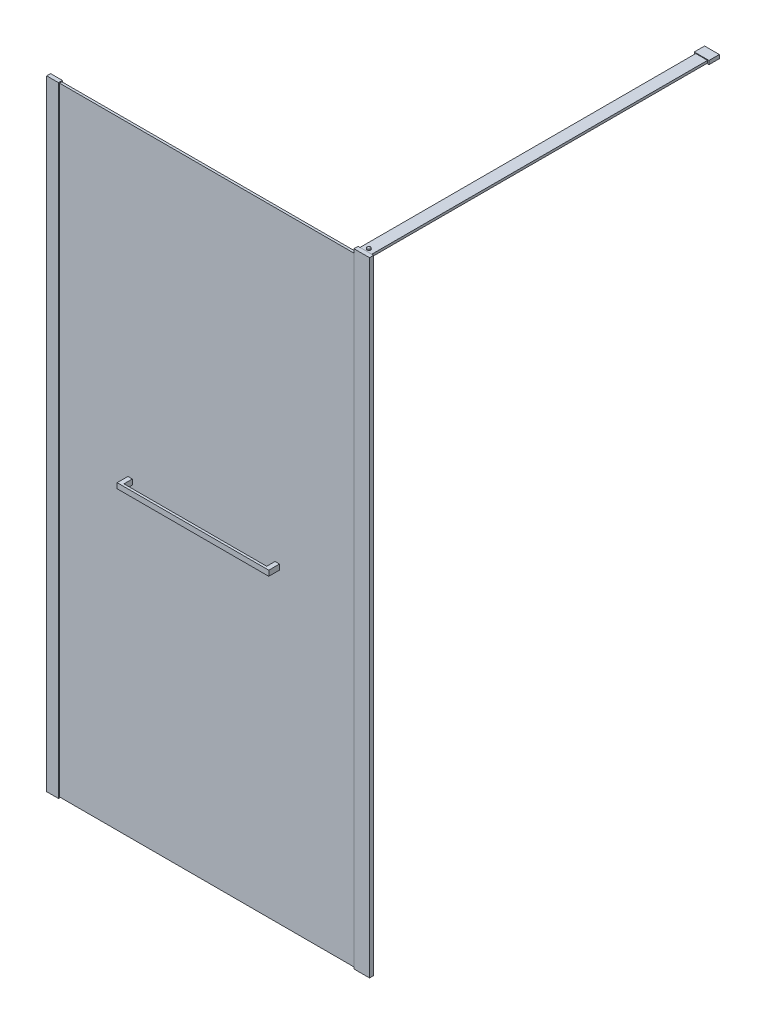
from build123d import *

# Parameters (mm, degrees)
DODANIE_WYCI_GNI_CIE1_START         = 3
DODANIE_WYCI_GNI_CIE1_DEPTH         = 2100
SZKIC2_W                            = 1047
SZKIC2_H                            = 8
DODANIE_WYCI_GNI_CIE2_DEPTH         = 2100
DODANIE_WYCI_GNI_CIE3_DEPTH         = 2108
SZKIC4_W                            = 40
SZKIC4_H                            = 13.3
DODANIE_WYCI_GNI_CIE4_DEPTH         = 3
SZKIC5_W                            = 53
SZKIC5_H                            = 14
DODANIE_WYCI_GNI_CIE5_DEPTH         = 8
DODANIE_WYCI_GNI_CIE6_START         = -1.3
SZKIC6_W                            = 8.1
SZKIC6_H                            = 7.8
DODANIE_WYCI_GNI_CIE6_DEPTH         = 15
SZKIC7_W                            = 53
SZKIC7_H                            = 14
DODANIE_WYCI_GNI_CIE7_DEPTH         = 3
SZKIC8_W                            = 40
SZKIC8_H                            = 13.3
DODANIE_WYCI_GNI_CIE8_DEPTH         = 3
SZKIC9_W                            = 40
SZKIC9_H                            = 8
DODANIE_WYCI_GNI_CIE9_DEPTH         = 1170
DODANIE_WYCI_GNI_CIE10_START        = -29.4
SZKIC10_W                           = 50
SZKIC10_H                           = 12.5
DODANIE_WYCI_GNI_CIE10_DEPTH        = 35
DODANIE_WYCI_GNI_CIE11_DEPTH        = 36.5
DODANIE_WYCI_GNI_CIE11_DEPTH_BACK   = 18
SZKIC12_W                           = 15
SZKIC12_H                           = 18
DODANIE_WYCI_GNI_CIE11_2_DEPTH      = 36.5
DODANIE_WYCI_GNI_CIE11_2_DEPTH_BACK = 18
SZKIC13_W                           = 8
SZKIC13_H                           = 18
DODANIE_WYCI_GNI_CIE12_DEPTH        = 485


with BuildPart() as part:
    # Szkic1 → Dodanie-wyci_gni_cie1 (new body)
    with BuildSketch(Plane(origin=(0, 0, 0), x_dir=(1, 0, 0), z_dir=(0, 1, 0)).offset(DODANIE_WYCI_GNI_CIE1_START)):
        Polygon((0, 0), (0, 13.3), (40, 13.3), (40, 11.4), (6.5, 11.4), (6.5, 3.4), (40, 3.4), (40, 0), align=None)
    extrude(amount=DODANIE_WYCI_GNI_CIE1_DEPTH)

    # Szkic4 → Dodanie-wyci_gni_cie4 (add)
    with BuildSketch(Plane(origin=(0, 2103, 0), x_dir=(1, 0, 0), z_dir=(0, 1, 0))):
        with Locations((20, 6.65)):
            Rectangle(SZKIC4_W, SZKIC4_H)
    extrude(amount=DODANIE_WYCI_GNI_CIE4_DEPTH)

    # Szkic8 → Dodanie-wyci_gni_cie8 (add)
    with BuildSketch(Plane.XZ.offset(-3)):
        with Locations((20, -6.65)):
            Rectangle(SZKIC8_W, SZKIC8_H)
    extrude(amount=DODANIE_WYCI_GNI_CIE8_DEPTH)


with BuildPart() as body_2:
    # Szkic2 → Dodanie-wyci_gni_cie2 (new body)
    with BuildSketch(Plane.XZ.offset(-3)):
        with Locations((530, -7.4)):
            Rectangle(SZKIC2_W, SZKIC2_H)
    extrude(amount=-DODANIE_WYCI_GNI_CIE2_DEPTH)


with BuildPart() as body_3:
    # Szkic3 → Dodanie-wyci_gni_cie3 (new body)
    with BuildSketch(Plane.XZ.offset(-3)):
        Polygon((1043.4, -3.4), (1043.4, -0.4), (1096.4, -0.4), (1096.4, -14.4), (1043.4, -14.4), (1043.4, -11.4), (1053.5, -11.4), (1053.5, -3.4), align=None)
    extrude(amount=-DODANIE_WYCI_GNI_CIE3_DEPTH)

    # Szkic5 → Dodanie-wyci_gni_cie5 (add)
    with BuildSketch(Plane(origin=(0, 2111, 0), x_dir=(1, 0, 0), z_dir=(0, 1, 0))):
        with Locations((1069.9, 7.4)):
            Rectangle(SZKIC5_W, SZKIC5_H)
    extrude(amount=DODANIE_WYCI_GNI_CIE5_DEPTH)

    # Szkic6 → Dodanie-wyci_gni_cie6 (add)
    with BuildSketch(Plane.ZY.offset(-1043.4).offset(DODANIE_WYCI_GNI_CIE6_START)):
        with Locations((-7.4, 2107.1)):
            Rectangle(SZKIC6_W, SZKIC6_H)
    extrude(amount=-DODANIE_WYCI_GNI_CIE6_DEPTH)

    # Szkic7 → Dodanie-wyci_gni_cie7 (add)
    with BuildSketch(Plane.XZ.offset(-3)):
        with Locations((1069.9, -7.4)):
            Rectangle(SZKIC7_W, SZKIC7_H)
    extrude(amount=DODANIE_WYCI_GNI_CIE7_DEPTH)


with BuildPart() as body_4:
    # Szkic9 → Dodanie-wyci_gni_cie9 (new body)
    with BuildSketch(Plane(origin=(0, 0, -14.4), x_dir=(-1, 0, 0), z_dir=(0, 0, -1))):
        with Locations((-1069.9, 2115)):
            Rectangle(SZKIC9_W, SZKIC9_H)
    extrude(amount=DODANIE_WYCI_GNI_CIE9_DEPTH)

    # Szkic10 → Dodanie-wyci_gni_cie10 (add)
    with BuildSketch(Plane(origin=(0, 0, -1184.4), x_dir=(-1, 0, 0), z_dir=(0, 0, -1)).offset(DODANIE_WYCI_GNI_CIE10_START)):
        with Locations((-1069.9, 2115)):
            Rectangle(SZKIC10_W, SZKIC10_H)
    extrude(amount=DODANIE_WYCI_GNI_CIE10_DEPTH)

    # Szkic11 → Obr_t1 (revolve)
    with BuildSketch(Plane(origin=(1069.9, 0, 0), x_dir=(0, 0, -1), z_dir=(1, 0, 0))):
        with BuildLine():
            Line((30.3, 2119), (30.05, 2122.8))
            ThreePointArc((30.05, 2122.8), (27.38045718, 2124.212280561), (24.4, 2124.7))
            Line((24.4, 2124.7), (24.4, 2124.2))
            ThreePointArc((24.4, 2124.2), (27.113886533, 2123.773650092), (29.566308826, 2122.535676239))
            Line((29.566308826, 2122.535676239), (29.798919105, 2119))
            Line((29.798919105, 2119), (30.3, 2119))
        make_face()
    revolve(axis=Axis((1069.9, 2119, -24.4), (0, 1, 0)))


with BuildPart() as body_5:
    # Szkic12 → Dodanie-wyci_gni_cie11 (new, two sides: drawn at the far end of the back side and taken through both)
    with BuildSketch(Plane.XY.offset(-3.4).offset(-DODANIE_WYCI_GNI_CIE11_DEPTH_BACK)):
        with Locations((280, 1053)):
            Rectangle(SZKIC12_W, SZKIC12_H)
    extrude(amount=DODANIE_WYCI_GNI_CIE11_DEPTH + DODANIE_WYCI_GNI_CIE11_DEPTH_BACK)



with BuildPart() as body_6:
    # Szkic12 → Dodanie-wyci_gni_cie11 2 (new, two sides: drawn at the far end of the back side and taken through both)
    with BuildSketch(Plane.XY.offset(-3.4).offset(-DODANIE_WYCI_GNI_CIE11_2_DEPTH_BACK)):
        with Locations((780, 1053)):
            Rectangle(SZKIC12_W, SZKIC12_H)
    extrude(amount=DODANIE_WYCI_GNI_CIE11_2_DEPTH + DODANIE_WYCI_GNI_CIE11_2_DEPTH_BACK)


with BuildPart() as body_5_1:
    add(body_5.part)

    add(body_6.part)  # Dodanie-wyci_gni_cie12 merges body 6
    # Szkic13 → Dodanie-wyci_gni_cie12 (add)
    with BuildSketch(Plane(origin=(287.5, 0, 0), x_dir=(0, 0, -1), z_dir=(1, 0, 0))):
        with Locations((-29.1, 1053)):
            Rectangle(SZKIC13_W, SZKIC13_H)
    extrude(amount=DODANIE_WYCI_GNI_CIE12_DEPTH)


solid = Compound([part.part, body_2.part, body_3.part, body_4.part, body_5_1.part])
